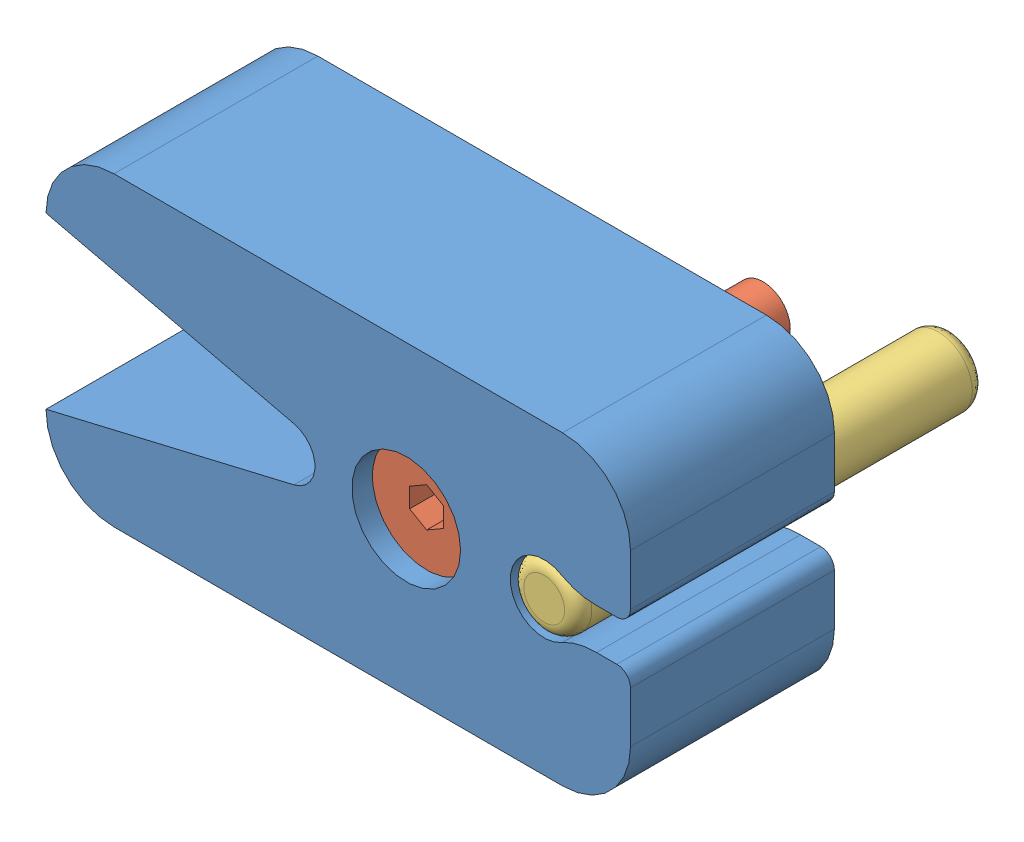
SolidWorks assembly MRT30M.sldasm, configuration Predeterminado (file format 11000). Lengths in mm.
Overall size (86 45 60).
3 component instances, 3 part files, 0 mates.
Components (placement in the parent):
- MRT30M-1-1: MRT30M-1.sldprt [Predeterminado] at origin size (86 45 30)
- BruyRubio_TPM__8_x_30-1: BruyRubio_TPM__8_x_30.sldprt [Predeterminado] at (0 22.5 20) size (16 16 50)
- PAS-10x60-1: PAS-10x60.sldprt [Predeterminado] at (20.3 22.5 -30) x (0 0 1) z (0 1 0) size (60 10 10)
